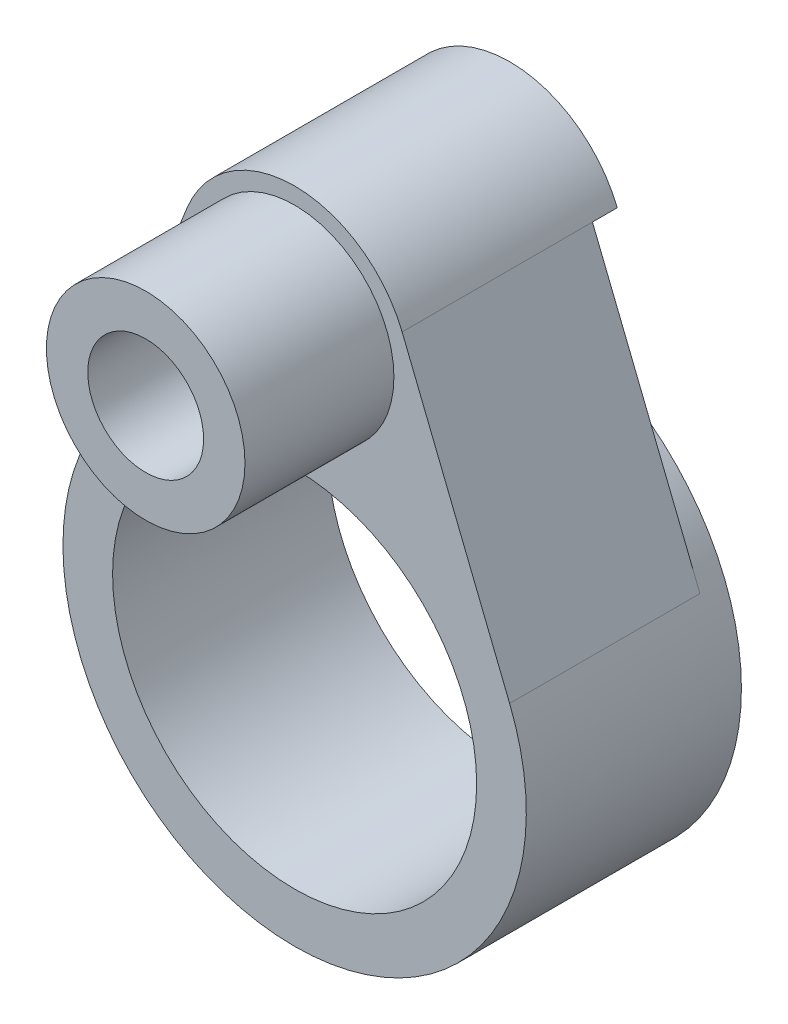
from build123d import *

# Parameters (mm, degrees)
ESQUISSE1_R             = 11
ESQUISSE1_R_2           = 3.5
BASE_EXTRUSION_DEPTH    = 13
ESQUISSE2_R             = 6
ESQUISSE2_R_2           = 3.5
BOSS_EXTRU_1_DEPTH      = 9
ENL_V_MAT_EXTRU_1_DEPTH = 1.5


with BuildPart() as part:
    # Esquisse1 → Base-Extrusion (new body)
    with BuildSketch(Plane.XY):
        with BuildLine():
            Line((-12.993347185, 5.212765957), (-6.496673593, 21.406382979))
            ThreePointArc((-6.496673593, 21.406382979), (0, 25.8), (6.496673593, 21.406382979))
            Line((6.496673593, 21.406382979), (12.993347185, 5.212765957))
            ThreePointArc((12.993347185, 5.212765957), (0, -14), (-12.993347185, 5.212765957))
        make_face()
        with Locations(Location((0, 0, 0), (0, 0, 180))):
            Circle(ESQUISSE1_R, mode=Mode.SUBTRACT)
        with Locations(Location((0, 18.8, 0), (0, 0, 131.868306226))):
            Circle(ESQUISSE1_R_2, mode=Mode.SUBTRACT)
    extrude(amount=BASE_EXTRUSION_DEPTH)

    # Esquisse2 → Boss.-Extru.1 (add)
    with BuildSketch(Plane.XY.offset(13)):
        with Locations((0, 18.8)):
            Circle(ESQUISSE2_R)
        with Locations(Location((0, 18.8, 0), (0, 0, 131.868306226))):
            Circle(ESQUISSE2_R_2, mode=Mode.SUBTRACT)
    extrude(amount=BOSS_EXTRU_1_DEPTH)

    # Esquisse3 → Enl_v. mat.-Extru.1 (cut)
    with BuildSketch(Plane(origin=(0, 0, 0), x_dir=(-1, 0, 0), z_dir=(0, 0, -1))):
        with BuildLine():
            Line((6.496673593, 21.406382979), (12.993347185, 5.212765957))
            ThreePointArc((12.993347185, 5.212765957), (0, 14), (-12.993347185, 5.212765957))
            Line((-12.993347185, 5.212765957), (-6.496673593, 21.406382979))
            Line((-6.496673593, 21.406382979), (6.496673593, 21.406382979))
        make_face()
    extrude(amount=-ENL_V_MAT_EXTRU_1_DEPTH, mode=Mode.SUBTRACT)


solid = part.part
